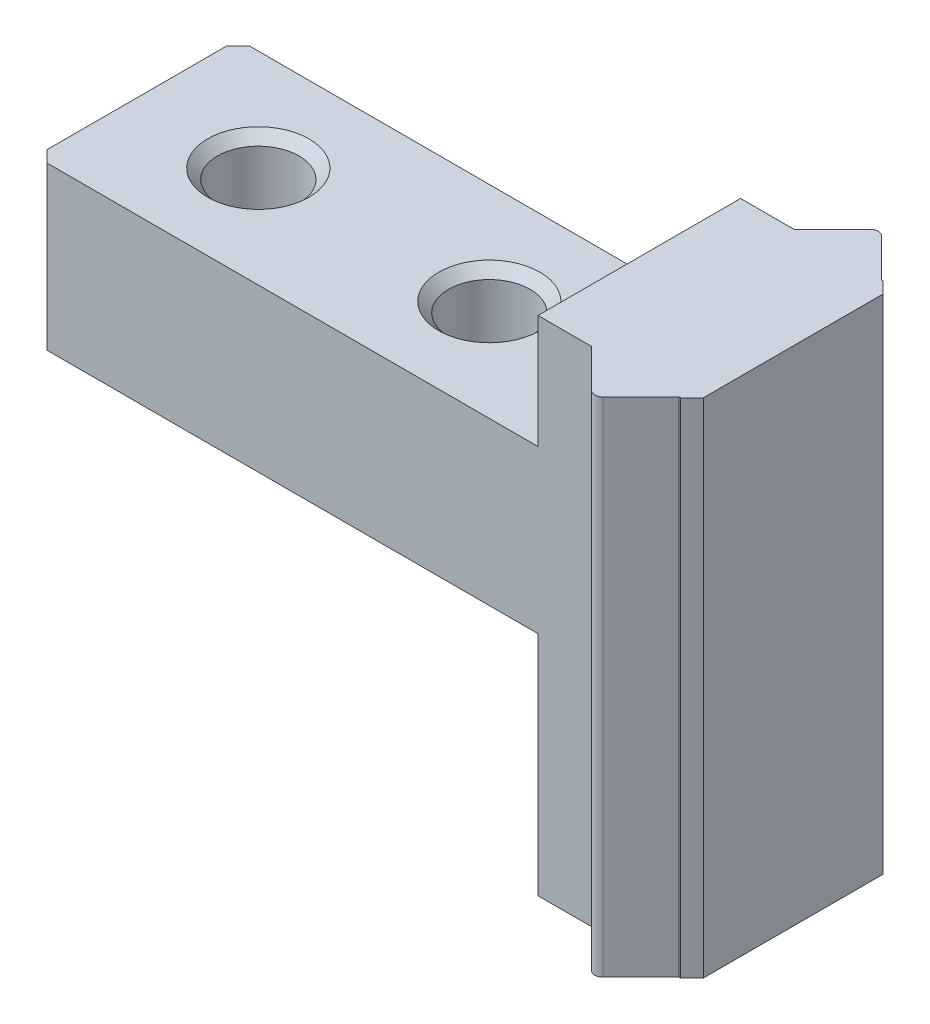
ISO-10303-21;
HEADER;
FILE_DESCRIPTION(('STEP AP214'),'2;1');
FILE_NAME('part.step','',(''),(''),'','','');
FILE_SCHEMA(('AUTOMOTIVE_DESIGN { 1 0 10303 214 1 1 1 1 }'));
ENDSEC;
DATA;
#1=APPLICATION_CONTEXT('core data for automotive mechanical design processes');
#2=APPLICATION_PROTOCOL_DEFINITION('international standard','automotive_design',2000,#1);
#3=PRODUCT_CONTEXT('',#1,'mechanical');
#4=PRODUCT('Part','Part','',(#3));
#5=PRODUCT_RELATED_PRODUCT_CATEGORY('part','',(#4));
#6=PRODUCT_DEFINITION_FORMATION('','',#4);
#7=PRODUCT_DEFINITION_CONTEXT('part definition',#1,'design');
#8=PRODUCT_DEFINITION('design','',#6,#7);
#9=PRODUCT_DEFINITION_SHAPE('','',#8);
#10=(LENGTH_UNIT() NAMED_UNIT(*) SI_UNIT(.MILLI.,.METRE.));
#11=(NAMED_UNIT(*) PLANE_ANGLE_UNIT() SI_UNIT($,.RADIAN.));
#12=(NAMED_UNIT(*) SI_UNIT($,.STERADIAN.) SOLID_ANGLE_UNIT());
#13=UNCERTAINTY_MEASURE_WITH_UNIT(LENGTH_MEASURE(1.E-05),#10,'distance_accuracy_value','');
#14=(GEOMETRIC_REPRESENTATION_CONTEXT(3) GLOBAL_UNCERTAINTY_ASSIGNED_CONTEXT((#13)) GLOBAL_UNIT_ASSIGNED_CONTEXT((#10,
#11,#12)) REPRESENTATION_CONTEXT('',''));
#15=CARTESIAN_POINT('',(0.,0.,0.));
#16=DIRECTION('',(0.,0.,1.));
#17=DIRECTION('',(1.,0.,0.));
#18=AXIS2_PLACEMENT_3D('',#15,#16,#17);
#19=CARTESIAN_POINT('',(-44.6,14.4,-2.5));
#20=DIRECTION('',(1.,0.,0.));
#21=DIRECTION('',(0.,0.,-1.));
#22=AXIS2_PLACEMENT_3D('',#19,#20,#21);
#23=PLANE('',#22);
#24=DIRECTION('',(0.,0.,-1.));
#25=VECTOR('',#24,1.);
#26=CARTESIAN_POINT('',(-44.6,11.6,2.5));
#27=LINE('',#26,#25);
#28=CARTESIAN_POINT('',(-44.6,11.6,2.5));
#29=VERTEX_POINT('',#28);
#30=CARTESIAN_POINT('',(-44.6,11.6,-2.5));
#31=VERTEX_POINT('',#30);
#32=EDGE_CURVE('E340',#29,#31,#27,.T.);
#33=ORIENTED_EDGE('',*,*,#32,.F.);
#34=DIRECTION('',(0.,-1.,0.));
#35=VECTOR('',#34,1.);
#36=CARTESIAN_POINT('',(-44.6,14.4,2.5));
#37=LINE('',#36,#35);
#38=CARTESIAN_POINT('',(-44.6,14.4,2.5));
#39=VERTEX_POINT('',#38);
#40=EDGE_CURVE('E11',#39,#29,#37,.T.);
#41=ORIENTED_EDGE('',*,*,#40,.F.);
#42=DIRECTION('',(0.,0.,1.));
#43=VECTOR('',#42,1.);
#44=CARTESIAN_POINT('',(-44.6,14.4,-2.5));
#45=LINE('',#44,#43);
#46=CARTESIAN_POINT('',(-44.6,14.4,-2.5));
#47=VERTEX_POINT('',#46);
#48=EDGE_CURVE('E187',#47,#39,#45,.T.);
#49=ORIENTED_EDGE('',*,*,#48,.F.);
#50=DIRECTION('',(0.,-1.,0.));
#51=VECTOR('',#50,1.);
#52=CARTESIAN_POINT('',(-44.6,14.4,-2.5));
#53=LINE('',#52,#51);
#54=EDGE_CURVE('E251',#47,#31,#53,.T.);
#55=ORIENTED_EDGE('',*,*,#54,.T.);
#56=EDGE_LOOP('',(#33,#41,#49,#55));
#57=FACE_BOUND('',#56,.T.);
#58=ADVANCED_FACE('F16',(#57),#23,.F.);
#59=CARTESIAN_POINT('',(-44.6,7.6,2.5));
#60=VERTEX_POINT('',#59);
#61=CARTESIAN_POINT('',(-44.6,2.,2.5));
#62=VERTEX_POINT('',#61);
#63=EDGE_CURVE('E25',#60,#62,#37,.T.);
#64=ORIENTED_EDGE('',*,*,#63,.F.);
#65=DIRECTION('',(0.,0.,-1.));
#66=VECTOR('',#65,1.);
#67=CARTESIAN_POINT('',(-44.6,7.6,2.5));
#68=LINE('',#67,#66);
#69=CARTESIAN_POINT('',(-44.6,7.6,-2.5));
#70=VERTEX_POINT('',#69);
#71=EDGE_CURVE('E33',#60,#70,#68,.T.);
#72=ORIENTED_EDGE('',*,*,#71,.T.);
#73=CARTESIAN_POINT('',(-44.6,2.,-2.5));
#74=VERTEX_POINT('',#73);
#75=EDGE_CURVE('E216',#70,#74,#53,.T.);
#76=ORIENTED_EDGE('',*,*,#75,.T.);
#77=DIRECTION('',(0.,0.,1.));
#78=VECTOR('',#77,1.);
#79=CARTESIAN_POINT('',(-44.6,2.,-2.5));
#80=LINE('',#79,#78);
#81=EDGE_CURVE('E179',#74,#62,#80,.T.);
#82=ORIENTED_EDGE('',*,*,#81,.T.);
#83=EDGE_LOOP('',(#64,#72,#76,#82));
#84=FACE_BOUND('',#83,.T.);
#85=ADVANCED_FACE('F18',(#84),#23,.F.);
#86=CARTESIAN_POINT('',(-44.6,14.4,2.5));
#87=DIRECTION('',(0.,0.,-1.));
#88=DIRECTION('',(-1.,0.,0.));
#89=AXIS2_PLACEMENT_3D('',#86,#87,#88);
#90=PLANE('',#89);
#91=DIRECTION('',(1.,0.,0.));
#92=VECTOR('',#91,1.);
#93=CARTESIAN_POINT('',(-44.6,2.,2.5));
#94=LINE('',#93,#92);
#95=CARTESIAN_POINT('',(-43.28,2.,2.5));
#96=VERTEX_POINT('',#95);
#97=EDGE_CURVE('E181',#62,#96,#94,.T.);
#98=ORIENTED_EDGE('',*,*,#97,.T.);
#99=DIRECTION('',(0.,-1.,0.));
#100=VECTOR('',#99,1.);
#101=CARTESIAN_POINT('',(-43.28,14.4,2.5));
#102=LINE('',#101,#100);
#103=CARTESIAN_POINT('',(-43.28,14.4,2.5));
#104=VERTEX_POINT('',#103);
#105=EDGE_CURVE('E254',#104,#96,#102,.T.);
#106=ORIENTED_EDGE('',*,*,#105,.F.);
#107=DIRECTION('',(1.,0.,0.));
#108=VECTOR('',#107,1.);
#109=CARTESIAN_POINT('',(-44.6,14.4,2.5));
#110=LINE('',#109,#108);
#111=EDGE_CURVE('E190',#39,#104,#110,.T.);
#112=ORIENTED_EDGE('',*,*,#111,.F.);
#113=ORIENTED_EDGE('',*,*,#40,.T.);
#114=DIRECTION('',(1.,0.,0.));
#115=VECTOR('',#114,1.);
#116=CARTESIAN_POINT('',(-56.7171572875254,11.6,2.5));
#117=LINE('',#116,#115);
#118=CARTESIAN_POINT('',(-56.7171572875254,11.6,2.5));
#119=VERTEX_POINT('',#118);
#120=EDGE_CURVE('E164',#119,#29,#117,.T.);
#121=ORIENTED_EDGE('',*,*,#120,.F.);
#122=DIRECTION('',(0.,-1.,0.));
#123=VECTOR('',#122,1.);
#124=CARTESIAN_POINT('',(-56.7171572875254,11.6,2.5));
#125=LINE('',#124,#123);
#126=CARTESIAN_POINT('',(-56.7171572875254,7.6,2.5));
#127=VERTEX_POINT('',#126);
#128=EDGE_CURVE('E160',#119,#127,#125,.T.);
#129=ORIENTED_EDGE('',*,*,#128,.T.);
#130=DIRECTION('',(1.,0.,0.));
#131=VECTOR('',#130,1.);
#132=CARTESIAN_POINT('',(-56.7171572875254,7.6,2.5));
#133=LINE('',#132,#131);
#134=EDGE_CURVE('E315',#127,#60,#133,.T.);
#135=ORIENTED_EDGE('',*,*,#134,.T.);
#136=ORIENTED_EDGE('',*,*,#63,.T.);
#137=EDGE_LOOP('',(#98,#106,#112,#113,#121,#129,#135,#136));
#138=FACE_BOUND('',#137,.T.);
#139=ADVANCED_FACE('F362',(#138),#90,.F.);
#140=CARTESIAN_POINT('',(-43.28,14.4,2.5));
#141=DIRECTION('',(0.707106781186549,0.,-0.707106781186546));
#142=DIRECTION('',(-0.707106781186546,0.,-0.707106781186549));
#143=AXIS2_PLACEMENT_3D('',#140,#141,#142);
#144=PLANE('',#143);
#145=DIRECTION('',(0.707106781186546,0.,0.707106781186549));
#146=VECTOR('',#145,1.);
#147=CARTESIAN_POINT('',(-43.28,2.,2.5));
#148=LINE('',#147,#146);
#149=CARTESIAN_POINT('',(-42.3414213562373,2.,3.43857864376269));
#150=VERTEX_POINT('',#149);
#151=EDGE_CURVE('E219',#96,#150,#148,.T.);
#152=ORIENTED_EDGE('',*,*,#151,.T.);
#153=DIRECTION('',(0.,-1.,0.));
#154=VECTOR('',#153,1.);
#155=CARTESIAN_POINT('',(-42.3414213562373,14.4,3.43857864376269));
#156=LINE('',#155,#154);
#157=CARTESIAN_POINT('',(-42.3414213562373,14.4,3.43857864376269));
#158=VERTEX_POINT('',#157);
#159=EDGE_CURVE('E260',#158,#150,#156,.T.);
#160=ORIENTED_EDGE('',*,*,#159,.F.);
#161=DIRECTION('',(0.707106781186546,0.,0.707106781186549));
#162=VECTOR('',#161,1.);
#163=CARTESIAN_POINT('',(-43.28,14.4,2.5));
#164=LINE('',#163,#162);
#165=EDGE_CURVE('E193',#104,#158,#164,.T.);
#166=ORIENTED_EDGE('',*,*,#165,.F.);
#167=ORIENTED_EDGE('',*,*,#105,.T.);
#168=EDGE_LOOP('',(#152,#160,#166,#167));
#169=FACE_BOUND('',#168,.T.);
#170=ADVANCED_FACE('F391',(#169),#144,.F.);
#171=CARTESIAN_POINT('',(-42.2,14.4,3.29715728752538));
#172=DIRECTION('',(0.,-1.,0.));
#173=DIRECTION('',(0.,0.,-1.));
#174=AXIS2_PLACEMENT_3D('',#171,#172,#173);
#175=CYLINDRICAL_SURFACE('',#174,0.199999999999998);
#176=CARTESIAN_POINT('',(-42.2,2.,3.29715728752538));
#177=DIRECTION('',(0.,1.,0.));
#178=DIRECTION('',(0.,0.,1.));
#179=AXIS2_PLACEMENT_3D('',#176,#177,#178);
#180=CIRCLE('',#179,0.199999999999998);
#181=CARTESIAN_POINT('',(-42.0585786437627,2.,3.43857864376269));
#182=VERTEX_POINT('',#181);
#183=EDGE_CURVE('E221',#150,#182,#180,.T.);
#184=ORIENTED_EDGE('',*,*,#183,.T.);
#185=DIRECTION('',(0.,-1.,0.));
#186=VECTOR('',#185,1.);
#187=CARTESIAN_POINT('',(-42.0585786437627,14.4,3.43857864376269));
#188=LINE('',#187,#186);
#189=CARTESIAN_POINT('',(-42.0585786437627,14.4,3.43857864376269));
#190=VERTEX_POINT('',#189);
#191=EDGE_CURVE('E263',#190,#182,#188,.T.);
#192=ORIENTED_EDGE('',*,*,#191,.F.);
#193=CARTESIAN_POINT('',(-42.2,14.4,3.29715728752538));
#194=DIRECTION('',(0.,1.,0.));
#195=DIRECTION('',(0.,0.,1.));
#196=AXIS2_PLACEMENT_3D('',#193,#194,#195);
#197=CIRCLE('',#196,0.199999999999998);
#198=EDGE_CURVE('E195',#158,#190,#197,.T.);
#199=ORIENTED_EDGE('',*,*,#198,.F.);
#200=ORIENTED_EDGE('',*,*,#159,.T.);
#201=EDGE_LOOP('',(#184,#192,#199,#200));
#202=FACE_BOUND('',#201,.T.);
#203=ADVANCED_FACE('F396',(#202),#175,.T.);
#204=CARTESIAN_POINT('',(-42.0585786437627,14.4,3.43857864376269));
#205=DIRECTION('',(-0.707106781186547,0.,-0.707106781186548));
#206=DIRECTION('',(-0.707106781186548,0.,0.707106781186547));
#207=AXIS2_PLACEMENT_3D('',#204,#205,#206);
#208=PLANE('',#207);
#209=DIRECTION('',(0.707106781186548,0.,-0.707106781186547));
#210=VECTOR('',#209,1.);
#211=CARTESIAN_POINT('',(-42.0585786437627,2.,3.43857864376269));
#212=LINE('',#211,#210);
#213=CARTESIAN_POINT('',(-41.12,2.,2.5));
#214=VERTEX_POINT('',#213);
#215=EDGE_CURVE('E223',#182,#214,#212,.T.);
#216=ORIENTED_EDGE('',*,*,#215,.T.);
#217=DIRECTION('',(0.,-1.,0.));
#218=VECTOR('',#217,1.);
#219=CARTESIAN_POINT('',(-41.12,14.4,2.5));
#220=LINE('',#219,#218);
#221=CARTESIAN_POINT('',(-41.12,14.4,2.5));
#222=VERTEX_POINT('',#221);
#223=EDGE_CURVE('E266',#222,#214,#220,.T.);
#224=ORIENTED_EDGE('',*,*,#223,.F.);
#225=DIRECTION('',(0.707106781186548,0.,-0.707106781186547));
#226=VECTOR('',#225,1.);
#227=CARTESIAN_POINT('',(-42.0585786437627,14.4,3.43857864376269));
#228=LINE('',#227,#226);
#229=EDGE_CURVE('E197',#190,#222,#228,.T.);
#230=ORIENTED_EDGE('',*,*,#229,.F.);
#231=ORIENTED_EDGE('',*,*,#191,.T.);
#232=EDGE_LOOP('',(#216,#224,#230,#231));
#233=FACE_BOUND('',#232,.T.);
#234=ADVANCED_FACE('F402',(#233),#208,.F.);
#235=CARTESIAN_POINT('',(-41.12,14.4,2.5));
#236=DIRECTION('',(0.,0.,-1.));
#237=DIRECTION('',(-1.,0.,0.));
#238=AXIS2_PLACEMENT_3D('',#235,#236,#237);
#239=PLANE('',#238);
#240=DIRECTION('',(1.,0.,0.));
#241=VECTOR('',#240,1.);
#242=CARTESIAN_POINT('',(-41.12,2.,2.5));
#243=LINE('',#242,#241);
#244=CARTESIAN_POINT('',(-41.0828427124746,2.,2.5));
#245=VERTEX_POINT('',#244);
#246=EDGE_CURVE('E225',#214,#245,#243,.T.);
#247=ORIENTED_EDGE('',*,*,#246,.T.);
#248=DIRECTION('',(0.,-1.,0.));
#249=VECTOR('',#248,1.);
#250=CARTESIAN_POINT('',(-41.0828427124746,14.4,2.5));
#251=LINE('',#250,#249);
#252=CARTESIAN_POINT('',(-41.0828427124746,14.4,2.5));
#253=VERTEX_POINT('',#252);
#254=EDGE_CURVE('E269',#253,#245,#251,.T.);
#255=ORIENTED_EDGE('',*,*,#254,.F.);
#256=DIRECTION('',(1.,0.,0.));
#257=VECTOR('',#256,1.);
#258=CARTESIAN_POINT('',(-41.12,14.4,2.5));
#259=LINE('',#258,#257);
#260=EDGE_CURVE('E199',#222,#253,#259,.T.);
#261=ORIENTED_EDGE('',*,*,#260,.F.);
#262=ORIENTED_EDGE('',*,*,#223,.T.);
#263=EDGE_LOOP('',(#247,#255,#261,#262));
#264=FACE_BOUND('',#263,.T.);
#265=ADVANCED_FACE('F406',(#264),#239,.F.);
#266=CARTESIAN_POINT('',(-41.0828427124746,14.4,2.5));
#267=DIRECTION('',(-0.707106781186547,0.,-0.707106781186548));
#268=DIRECTION('',(-0.707106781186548,0.,0.707106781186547));
#269=AXIS2_PLACEMENT_3D('',#266,#267,#268);
#270=PLANE('',#269);
#271=DIRECTION('',(0.707106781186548,0.,-0.707106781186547));
#272=VECTOR('',#271,1.);
#273=CARTESIAN_POINT('',(-41.0828427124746,2.,2.5));
#274=LINE('',#273,#272);
#275=CARTESIAN_POINT('',(-40.8,2.,2.21715728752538));
#276=VERTEX_POINT('',#275);
#277=EDGE_CURVE('E227',#245,#276,#274,.T.);
#278=ORIENTED_EDGE('',*,*,#277,.T.);
#279=DIRECTION('',(0.,-1.,0.));
#280=VECTOR('',#279,1.);
#281=CARTESIAN_POINT('',(-40.8,14.4,2.21715728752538));
#282=LINE('',#281,#280);
#283=CARTESIAN_POINT('',(-40.8,14.4,2.21715728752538));
#284=VERTEX_POINT('',#283);
#285=EDGE_CURVE('E272',#284,#276,#282,.T.);
#286=ORIENTED_EDGE('',*,*,#285,.F.);
#287=DIRECTION('',(0.707106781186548,0.,-0.707106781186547));
#288=VECTOR('',#287,1.);
#289=CARTESIAN_POINT('',(-41.0828427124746,14.4,2.5));
#290=LINE('',#289,#288);
#291=EDGE_CURVE('E201',#253,#284,#290,.T.);
#292=ORIENTED_EDGE('',*,*,#291,.F.);
#293=ORIENTED_EDGE('',*,*,#254,.T.);
#294=EDGE_LOOP('',(#278,#286,#292,#293));
#295=FACE_BOUND('',#294,.T.);
#296=ADVANCED_FACE('F410',(#295),#270,.F.);
#297=CARTESIAN_POINT('',(-40.8,14.4,2.21715728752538));
#298=DIRECTION('',(-1.,0.,0.));
#299=DIRECTION('',(0.,0.,1.));
#300=AXIS2_PLACEMENT_3D('',#297,#298,#299);
#301=PLANE('',#300);
#302=DIRECTION('',(0.,0.,-1.));
#303=VECTOR('',#302,1.);
#304=CARTESIAN_POINT('',(-40.8,2.,2.21715728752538));
#305=LINE('',#304,#303);
#306=CARTESIAN_POINT('',(-40.8,2.,-2.21715728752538));
#307=VERTEX_POINT('',#306);
#308=EDGE_CURVE('E229',#276,#307,#305,.T.);
#309=ORIENTED_EDGE('',*,*,#308,.T.);
#310=DIRECTION('',(0.,-1.,0.));
#311=VECTOR('',#310,1.);
#312=CARTESIAN_POINT('',(-40.8,14.4,-2.21715728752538));
#313=LINE('',#312,#311);
#314=CARTESIAN_POINT('',(-40.8,14.4,-2.21715728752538));
#315=VERTEX_POINT('',#314);
#316=EDGE_CURVE('E275',#315,#307,#313,.T.);
#317=ORIENTED_EDGE('',*,*,#316,.F.);
#318=DIRECTION('',(0.,0.,-1.));
#319=VECTOR('',#318,1.);
#320=CARTESIAN_POINT('',(-40.8,14.4,2.21715728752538));
#321=LINE('',#320,#319);
#322=EDGE_CURVE('E203',#284,#315,#321,.T.);
#323=ORIENTED_EDGE('',*,*,#322,.F.);
#324=ORIENTED_EDGE('',*,*,#285,.T.);
#325=EDGE_LOOP('',(#309,#317,#323,#324));
#326=FACE_BOUND('',#325,.T.);
#327=ADVANCED_FACE('F414',(#326),#301,.F.);
#328=CARTESIAN_POINT('',(-40.8,14.4,-2.21715728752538));
#329=DIRECTION('',(-0.707106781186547,0.,0.707106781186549));
#330=DIRECTION('',(0.707106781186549,0.,0.707106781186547));
#331=AXIS2_PLACEMENT_3D('',#328,#329,#330);
#332=PLANE('',#331);
#333=DIRECTION('',(-0.707106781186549,0.,-0.707106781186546));
#334=VECTOR('',#333,1.);
#335=CARTESIAN_POINT('',(-40.8,2.,-2.21715728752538));
#336=LINE('',#335,#334);
#337=CARTESIAN_POINT('',(-41.0828427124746,2.,-2.5));
#338=VERTEX_POINT('',#337);
#339=EDGE_CURVE('E231',#307,#338,#336,.T.);
#340=ORIENTED_EDGE('',*,*,#339,.T.);
#341=DIRECTION('',(0.,-1.,0.));
#342=VECTOR('',#341,1.);
#343=CARTESIAN_POINT('',(-41.0828427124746,14.4,-2.5));
#344=LINE('',#343,#342);
#345=CARTESIAN_POINT('',(-41.0828427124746,14.4,-2.5));
#346=VERTEX_POINT('',#345);
#347=EDGE_CURVE('E278',#346,#338,#344,.T.);
#348=ORIENTED_EDGE('',*,*,#347,.F.);
#349=DIRECTION('',(-0.707106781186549,0.,-0.707106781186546));
#350=VECTOR('',#349,1.);
#351=CARTESIAN_POINT('',(-40.8,14.4,-2.21715728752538));
#352=LINE('',#351,#350);
#353=EDGE_CURVE('E205',#315,#346,#352,.T.);
#354=ORIENTED_EDGE('',*,*,#353,.F.);
#355=ORIENTED_EDGE('',*,*,#316,.T.);
#356=EDGE_LOOP('',(#340,#348,#354,#355));
#357=FACE_BOUND('',#356,.T.);
#358=ADVANCED_FACE('F418',(#357),#332,.F.);
#359=CARTESIAN_POINT('',(-41.0828427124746,14.4,-2.5));
#360=DIRECTION('',(0.,0.,1.));
#361=DIRECTION('',(1.,0.,0.));
#362=AXIS2_PLACEMENT_3D('',#359,#360,#361);
#363=PLANE('',#362);
#364=DIRECTION('',(-1.,0.,0.));
#365=VECTOR('',#364,1.);
#366=CARTESIAN_POINT('',(-41.0828427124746,2.,-2.5));
#367=LINE('',#366,#365);
#368=CARTESIAN_POINT('',(-41.12,2.,-2.5));
#369=VERTEX_POINT('',#368);
#370=EDGE_CURVE('E233',#338,#369,#367,.T.);
#371=ORIENTED_EDGE('',*,*,#370,.T.);
#372=DIRECTION('',(0.,-1.,0.));
#373=VECTOR('',#372,1.);
#374=CARTESIAN_POINT('',(-41.12,14.4,-2.5));
#375=LINE('',#374,#373);
#376=CARTESIAN_POINT('',(-41.12,14.4,-2.5));
#377=VERTEX_POINT('',#376);
#378=EDGE_CURVE('E281',#377,#369,#375,.T.);
#379=ORIENTED_EDGE('',*,*,#378,.F.);
#380=DIRECTION('',(-1.,0.,0.));
#381=VECTOR('',#380,1.);
#382=CARTESIAN_POINT('',(-41.0828427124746,14.4,-2.5));
#383=LINE('',#382,#381);
#384=EDGE_CURVE('E207',#346,#377,#383,.T.);
#385=ORIENTED_EDGE('',*,*,#384,.F.);
#386=ORIENTED_EDGE('',*,*,#347,.T.);
#387=EDGE_LOOP('',(#371,#379,#385,#386));
#388=FACE_BOUND('',#387,.T.);
#389=ADVANCED_FACE('F422',(#388),#363,.F.);
#390=CARTESIAN_POINT('',(-41.12,14.4,-2.5));
#391=DIRECTION('',(-0.707106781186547,0.,0.707106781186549));
#392=DIRECTION('',(0.707106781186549,0.,0.707106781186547));
#393=AXIS2_PLACEMENT_3D('',#390,#391,#392);
#394=PLANE('',#393);
#395=DIRECTION('',(-0.707106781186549,0.,-0.707106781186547));
#396=VECTOR('',#395,1.);
#397=CARTESIAN_POINT('',(-41.12,2.,-2.5));
#398=LINE('',#397,#396);
#399=CARTESIAN_POINT('',(-42.0585786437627,2.,-3.43857864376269));
#400=VERTEX_POINT('',#399);
#401=EDGE_CURVE('E235',#369,#400,#398,.T.);
#402=ORIENTED_EDGE('',*,*,#401,.T.);
#403=DIRECTION('',(0.,-1.,0.));
#404=VECTOR('',#403,1.);
#405=CARTESIAN_POINT('',(-42.0585786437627,14.4,-3.43857864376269));
#406=LINE('',#405,#404);
#407=CARTESIAN_POINT('',(-42.0585786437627,14.4,-3.43857864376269));
#408=VERTEX_POINT('',#407);
#409=EDGE_CURVE('E284',#408,#400,#406,.T.);
#410=ORIENTED_EDGE('',*,*,#409,.F.);
#411=DIRECTION('',(-0.707106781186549,0.,-0.707106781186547));
#412=VECTOR('',#411,1.);
#413=CARTESIAN_POINT('',(-41.12,14.4,-2.5));
#414=LINE('',#413,#412);
#415=EDGE_CURVE('E209',#377,#408,#414,.T.);
#416=ORIENTED_EDGE('',*,*,#415,.F.);
#417=ORIENTED_EDGE('',*,*,#378,.T.);
#418=EDGE_LOOP('',(#402,#410,#416,#417));
#419=FACE_BOUND('',#418,.T.);
#420=ADVANCED_FACE('F379',(#419),#394,.F.);
#421=CARTESIAN_POINT('',(-42.2,14.4,-3.29715728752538));
#422=DIRECTION('',(0.,-1.,0.));
#423=DIRECTION('',(0.,0.,-1.));
#424=AXIS2_PLACEMENT_3D('',#421,#422,#423);
#425=CYLINDRICAL_SURFACE('',#424,0.199999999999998);
#426=CARTESIAN_POINT('',(-42.2,2.,-3.29715728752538));
#427=DIRECTION('',(0.,1.,0.));
#428=DIRECTION('',(0.,0.,1.));
#429=AXIS2_PLACEMENT_3D('',#426,#427,#428);
#430=CIRCLE('',#429,0.199999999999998);
#431=CARTESIAN_POINT('',(-42.3414213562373,2.,-3.43857864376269));
#432=VERTEX_POINT('',#431);
#433=EDGE_CURVE('E237',#400,#432,#430,.T.);
#434=ORIENTED_EDGE('',*,*,#433,.T.);
#435=DIRECTION('',(0.,-1.,0.));
#436=VECTOR('',#435,1.);
#437=CARTESIAN_POINT('',(-42.3414213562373,14.4,-3.43857864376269));
#438=LINE('',#437,#436);
#439=CARTESIAN_POINT('',(-42.3414213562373,14.4,-3.43857864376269));
#440=VERTEX_POINT('',#439);
#441=EDGE_CURVE('E286',#440,#432,#438,.T.);
#442=ORIENTED_EDGE('',*,*,#441,.F.);
#443=CARTESIAN_POINT('',(-42.2,14.4,-3.29715728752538));
#444=DIRECTION('',(0.,1.,0.));
#445=DIRECTION('',(0.,0.,1.));
#446=AXIS2_PLACEMENT_3D('',#443,#444,#445);
#447=CIRCLE('',#446,0.199999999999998);
#448=EDGE_CURVE('E211',#408,#440,#447,.T.);
#449=ORIENTED_EDGE('',*,*,#448,.F.);
#450=ORIENTED_EDGE('',*,*,#409,.T.);
#451=EDGE_LOOP('',(#434,#442,#449,#450));
#452=FACE_BOUND('',#451,.T.);
#453=ADVANCED_FACE('F370',(#452),#425,.T.);
#454=CARTESIAN_POINT('',(-42.3414213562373,14.4,-3.43857864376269));
#455=DIRECTION('',(0.707106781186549,0.,0.707106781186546));
#456=DIRECTION('',(0.707106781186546,0.,-0.707106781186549));
#457=AXIS2_PLACEMENT_3D('',#454,#455,#456);
#458=PLANE('',#457);
#459=DIRECTION('',(-0.707106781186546,0.,0.707106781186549));
#460=VECTOR('',#459,1.);
#461=CARTESIAN_POINT('',(-42.3414213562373,2.,-3.43857864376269));
#462=LINE('',#461,#460);
#463=CARTESIAN_POINT('',(-43.28,2.,-2.5));
#464=VERTEX_POINT('',#463);
#465=EDGE_CURVE('E239',#432,#464,#462,.T.);
#466=ORIENTED_EDGE('',*,*,#465,.T.);
#467=DIRECTION('',(0.,-1.,0.));
#468=VECTOR('',#467,1.);
#469=CARTESIAN_POINT('',(-43.28,14.4,-2.5));
#470=LINE('',#469,#468);
#471=CARTESIAN_POINT('',(-43.28,14.4,-2.5));
#472=VERTEX_POINT('',#471);
#473=EDGE_CURVE('E245',#472,#464,#470,.T.);
#474=ORIENTED_EDGE('',*,*,#473,.F.);
#475=DIRECTION('',(-0.707106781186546,0.,0.707106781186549));
#476=VECTOR('',#475,1.);
#477=CARTESIAN_POINT('',(-42.3414213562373,14.4,-3.43857864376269));
#478=LINE('',#477,#476);
#479=EDGE_CURVE('E213',#440,#472,#478,.T.);
#480=ORIENTED_EDGE('',*,*,#479,.F.);
#481=ORIENTED_EDGE('',*,*,#441,.T.);
#482=EDGE_LOOP('',(#466,#474,#480,#481));
#483=FACE_BOUND('',#482,.T.);
#484=ADVANCED_FACE('F368',(#483),#458,.F.);
#485=CARTESIAN_POINT('',(-43.28,14.4,-2.5));
#486=DIRECTION('',(0.,0.,1.));
#487=DIRECTION('',(1.,0.,0.));
#488=AXIS2_PLACEMENT_3D('',#485,#486,#487);
#489=PLANE('',#488);
#490=DIRECTION('',(-1.,0.,0.));
#491=VECTOR('',#490,1.);
#492=CARTESIAN_POINT('',(-43.28,2.,-2.5));
#493=LINE('',#492,#491);
#494=EDGE_CURVE('E191',#464,#74,#493,.T.);
#495=ORIENTED_EDGE('',*,*,#494,.T.);
#496=ORIENTED_EDGE('',*,*,#75,.F.);
#497=DIRECTION('',(-1.,0.,0.));
#498=VECTOR('',#497,1.);
#499=CARTESIAN_POINT('',(-44.6,7.6,-2.5));
#500=LINE('',#499,#498);
#501=CARTESIAN_POINT('',(-56.7171572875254,7.6,-2.5));
#502=VERTEX_POINT('',#501);
#503=EDGE_CURVE('E307',#70,#502,#500,.T.);
#504=ORIENTED_EDGE('',*,*,#503,.T.);
#505=DIRECTION('',(0.,-1.,0.));
#506=VECTOR('',#505,1.);
#507=CARTESIAN_POINT('',(-56.7171572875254,11.6,-2.5));
#508=LINE('',#507,#506);
#509=CARTESIAN_POINT('',(-56.7171572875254,11.6,-2.5));
#510=VERTEX_POINT('',#509);
#511=EDGE_CURVE('E183',#510,#502,#508,.T.);
#512=ORIENTED_EDGE('',*,*,#511,.F.);
#513=DIRECTION('',(-1.,0.,0.));
#514=VECTOR('',#513,1.);
#515=CARTESIAN_POINT('',(-44.6,11.6,-2.5));
#516=LINE('',#515,#514);
#517=EDGE_CURVE('E343',#31,#510,#516,.T.);
#518=ORIENTED_EDGE('',*,*,#517,.F.);
#519=ORIENTED_EDGE('',*,*,#54,.F.);
#520=DIRECTION('',(-1.,0.,0.));
#521=VECTOR('',#520,1.);
#522=CARTESIAN_POINT('',(-43.28,14.4,-2.5));
#523=LINE('',#522,#521);
#524=EDGE_CURVE('E215',#472,#47,#523,.T.);
#525=ORIENTED_EDGE('',*,*,#524,.F.);
#526=ORIENTED_EDGE('',*,*,#473,.T.);
#527=EDGE_LOOP('',(#495,#496,#504,#512,#518,#519,#525,#526));
#528=FACE_BOUND('',#527,.T.);
#529=ADVANCED_FACE('F297',(#528),#489,.F.);
#530=CARTESIAN_POINT('',(-42.2,14.4,3.29715728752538));
#531=DIRECTION('',(0.,1.,0.));
#532=DIRECTION('',(0.,0.,1.));
#533=AXIS2_PLACEMENT_3D('',#530,#531,#532);
#534=PLANE('',#533);
#535=ORIENTED_EDGE('',*,*,#48,.T.);
#536=ORIENTED_EDGE('',*,*,#111,.T.);
#537=ORIENTED_EDGE('',*,*,#165,.T.);
#538=ORIENTED_EDGE('',*,*,#198,.T.);
#539=ORIENTED_EDGE('',*,*,#229,.T.);
#540=ORIENTED_EDGE('',*,*,#260,.T.);
#541=ORIENTED_EDGE('',*,*,#291,.T.);
#542=ORIENTED_EDGE('',*,*,#322,.T.);
#543=ORIENTED_EDGE('',*,*,#353,.T.);
#544=ORIENTED_EDGE('',*,*,#384,.T.);
#545=ORIENTED_EDGE('',*,*,#415,.T.);
#546=ORIENTED_EDGE('',*,*,#448,.T.);
#547=ORIENTED_EDGE('',*,*,#479,.T.);
#548=ORIENTED_EDGE('',*,*,#524,.T.);
#549=EDGE_LOOP('',(#535,#536,#537,#538,#539,#540,#541,#542,#543,#544,#545,#546,#547,#548));
#550=FACE_BOUND('',#549,.T.);
#551=ADVANCED_FACE('F366',(#550),#534,.T.);
#552=CARTESIAN_POINT('',(-42.2,2.,3.29715728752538));
#553=DIRECTION('',(0.,1.,0.));
#554=DIRECTION('',(0.,0.,1.));
#555=AXIS2_PLACEMENT_3D('',#552,#553,#554);
#556=PLANE('',#555);
#557=ORIENTED_EDGE('',*,*,#81,.F.);
#558=ORIENTED_EDGE('',*,*,#494,.F.);
#559=ORIENTED_EDGE('',*,*,#465,.F.);
#560=ORIENTED_EDGE('',*,*,#433,.F.);
#561=ORIENTED_EDGE('',*,*,#401,.F.);
#562=ORIENTED_EDGE('',*,*,#370,.F.);
#563=ORIENTED_EDGE('',*,*,#339,.F.);
#564=ORIENTED_EDGE('',*,*,#308,.F.);
#565=ORIENTED_EDGE('',*,*,#277,.F.);
#566=ORIENTED_EDGE('',*,*,#246,.F.);
#567=ORIENTED_EDGE('',*,*,#215,.F.);
#568=ORIENTED_EDGE('',*,*,#183,.F.);
#569=ORIENTED_EDGE('',*,*,#151,.F.);
#570=ORIENTED_EDGE('',*,*,#97,.F.);
#571=EDGE_LOOP('',(#557,#558,#559,#560,#561,#562,#563,#564,#565,#566,#567,#568,#569,#570));
#572=FACE_BOUND('',#571,.T.);
#573=ADVANCED_FACE('F301',(#572),#556,.F.);
#574=CARTESIAN_POINT('',(-57.,11.6,-2.21715728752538));
#575=DIRECTION('',(1.,0.,0.));
#576=DIRECTION('',(0.,0.,-1.));
#577=AXIS2_PLACEMENT_3D('',#574,#575,#576);
#578=PLANE('',#577);
#579=DIRECTION('',(0.,0.,1.));
#580=VECTOR('',#579,1.);
#581=CARTESIAN_POINT('',(-57.,7.6,-2.21715728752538));
#582=LINE('',#581,#580);
#583=CARTESIAN_POINT('',(-57.,7.6,-2.21715728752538));
#584=VERTEX_POINT('',#583);
#585=CARTESIAN_POINT('',(-57.,7.6,2.21715728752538));
#586=VERTEX_POINT('',#585);
#587=EDGE_CURVE('E178',#584,#586,#582,.T.);
#588=ORIENTED_EDGE('',*,*,#587,.T.);
#589=DIRECTION('',(0.,-1.,0.));
#590=VECTOR('',#589,1.);
#591=CARTESIAN_POINT('',(-57.,11.6,2.21715728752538));
#592=LINE('',#591,#590);
#593=CARTESIAN_POINT('',(-57.,11.6,2.21715728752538));
#594=VERTEX_POINT('',#593);
#595=EDGE_CURVE('E157',#594,#586,#592,.T.);
#596=ORIENTED_EDGE('',*,*,#595,.F.);
#597=DIRECTION('',(0.,0.,1.));
#598=VECTOR('',#597,1.);
#599=CARTESIAN_POINT('',(-57.,11.6,-2.21715728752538));
#600=LINE('',#599,#598);
#601=CARTESIAN_POINT('',(-57.,11.6,-2.21715728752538));
#602=VERTEX_POINT('',#601);
#603=EDGE_CURVE('E165',#602,#594,#600,.T.);
#604=ORIENTED_EDGE('',*,*,#603,.F.);
#605=DIRECTION('',(0.,-1.,0.));
#606=VECTOR('',#605,1.);
#607=CARTESIAN_POINT('',(-57.,11.6,-2.21715728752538));
#608=LINE('',#607,#606);
#609=EDGE_CURVE('E355',#602,#584,#608,.T.);
#610=ORIENTED_EDGE('',*,*,#609,.T.);
#611=EDGE_LOOP('',(#588,#596,#604,#610));
#612=FACE_BOUND('',#611,.T.);
#613=ADVANCED_FACE('F176',(#612),#578,.F.);
#614=CARTESIAN_POINT('',(-57.,11.6,2.21715728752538));
#615=DIRECTION('',(0.707106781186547,0.,-0.707106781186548));
#616=DIRECTION('',(-0.707106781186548,0.,-0.707106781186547));
#617=AXIS2_PLACEMENT_3D('',#614,#615,#616);
#618=PLANE('',#617);
#619=DIRECTION('',(0.707106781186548,0.,0.707106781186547));
#620=VECTOR('',#619,1.);
#621=CARTESIAN_POINT('',(-57.,7.6,2.21715728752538));
#622=LINE('',#621,#620);
#623=EDGE_CURVE('E326',#586,#127,#622,.T.);
#624=ORIENTED_EDGE('',*,*,#623,.T.);
#625=ORIENTED_EDGE('',*,*,#128,.F.);
#626=DIRECTION('',(0.707106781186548,0.,0.707106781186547));
#627=VECTOR('',#626,1.);
#628=CARTESIAN_POINT('',(-57.,11.6,2.21715728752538));
#629=LINE('',#628,#627);
#630=EDGE_CURVE('E153',#594,#119,#629,.T.);
#631=ORIENTED_EDGE('',*,*,#630,.F.);
#632=ORIENTED_EDGE('',*,*,#595,.T.);
#633=EDGE_LOOP('',(#624,#625,#631,#632));
#634=FACE_BOUND('',#633,.T.);
#635=ADVANCED_FACE('F155',(#634),#618,.F.);
#636=CARTESIAN_POINT('',(-56.7171572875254,11.6,-2.5));
#637=DIRECTION('',(0.707106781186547,0.,0.707106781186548));
#638=DIRECTION('',(0.707106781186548,0.,-0.707106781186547));
#639=AXIS2_PLACEMENT_3D('',#636,#637,#638);
#640=PLANE('',#639);
#641=DIRECTION('',(-0.707106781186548,0.,0.707106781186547));
#642=VECTOR('',#641,1.);
#643=CARTESIAN_POINT('',(-56.7171572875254,7.6,-2.5));
#644=LINE('',#643,#642);
#645=EDGE_CURVE('E174',#502,#584,#644,.T.);
#646=ORIENTED_EDGE('',*,*,#645,.T.);
#647=ORIENTED_EDGE('',*,*,#609,.F.);
#648=DIRECTION('',(-0.707106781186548,0.,0.707106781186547));
#649=VECTOR('',#648,1.);
#650=CARTESIAN_POINT('',(-56.7171572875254,11.6,-2.5));
#651=LINE('',#650,#649);
#652=EDGE_CURVE('E170',#510,#602,#651,.T.);
#653=ORIENTED_EDGE('',*,*,#652,.F.);
#654=ORIENTED_EDGE('',*,*,#511,.T.);
#655=EDGE_LOOP('',(#646,#647,#653,#654));
#656=FACE_BOUND('',#655,.T.);
#657=ADVANCED_FACE('F357',(#656),#640,.F.);
#658=CARTESIAN_POINT('',(0.,11.6,0.));
#659=DIRECTION('',(0.,1.,0.));
#660=DIRECTION('',(0.,0.,1.));
#661=AXIS2_PLACEMENT_3D('',#658,#659,#660);
#662=PLANE('',#661);
#663=CARTESIAN_POINT('',(-48.3,11.6,0.));
#664=DIRECTION('',(0.,-1.,0.));
#665=DIRECTION('',(0.,0.,-1.));
#666=AXIS2_PLACEMENT_3D('',#663,#664,#665);
#667=CIRCLE('',#666,1.25);
#668=CARTESIAN_POINT('',(-48.3,11.6,-1.25));
#669=VERTEX_POINT('',#668);
#670=EDGE_CURVE('E755',#669,#669,#667,.T.);
#671=ORIENTED_EDGE('',*,*,#670,.T.);
#672=EDGE_LOOP('',(#671));
#673=FACE_BOUND('',#672,.T.);
#674=CARTESIAN_POINT('',(-54.,11.6,0.));
#675=DIRECTION('',(0.,-1.,0.));
#676=DIRECTION('',(0.,0.,-1.));
#677=AXIS2_PLACEMENT_3D('',#674,#675,#676);
#678=CIRCLE('',#677,1.25);
#679=CARTESIAN_POINT('',(-54.,11.6,-1.25));
#680=VERTEX_POINT('',#679);
#681=EDGE_CURVE('E334',#680,#680,#678,.T.);
#682=ORIENTED_EDGE('',*,*,#681,.T.);
#683=EDGE_LOOP('',(#682));
#684=FACE_BOUND('',#683,.T.);
#685=ORIENTED_EDGE('',*,*,#603,.T.);
#686=ORIENTED_EDGE('',*,*,#630,.T.);
#687=ORIENTED_EDGE('',*,*,#120,.T.);
#688=ORIENTED_EDGE('',*,*,#32,.T.);
#689=ORIENTED_EDGE('',*,*,#517,.T.);
#690=ORIENTED_EDGE('',*,*,#652,.T.);
#691=EDGE_LOOP('',(#685,#686,#687,#688,#689,#690));
#692=FACE_BOUND('',#691,.T.);
#693=ADVANCED_FACE('F168',(#673,#684,#692),#662,.T.);
#694=CARTESIAN_POINT('',(0.,7.6,0.));
#695=DIRECTION('',(0.,1.,0.));
#696=DIRECTION('',(0.,0.,1.));
#697=AXIS2_PLACEMENT_3D('',#694,#695,#696);
#698=PLANE('',#697);
#699=CARTESIAN_POINT('',(-48.3,7.6,0.));
#700=DIRECTION('',(0.,1.,0.));
#701=DIRECTION('',(0.,0.,1.));
#702=AXIS2_PLACEMENT_3D('',#699,#700,#701);
#703=CIRCLE('',#702,1.24);
#704=CARTESIAN_POINT('',(-48.3,7.6,1.24));
#705=VERTEX_POINT('',#704);
#706=EDGE_CURVE('E20',#705,#705,#703,.F.);
#707=ORIENTED_EDGE('',*,*,#706,.F.);
#708=EDGE_LOOP('',(#707));
#709=FACE_BOUND('',#708,.T.);
#710=CARTESIAN_POINT('',(-54.,7.6,0.));
#711=DIRECTION('',(0.,1.,0.));
#712=DIRECTION('',(0.,0.,1.));
#713=AXIS2_PLACEMENT_3D('',#710,#711,#712);
#714=CIRCLE('',#713,1.24);
#715=CARTESIAN_POINT('',(-54.,7.6,1.24));
#716=VERTEX_POINT('',#715);
#717=EDGE_CURVE('E321',#716,#716,#714,.F.);
#718=ORIENTED_EDGE('',*,*,#717,.F.);
#719=EDGE_LOOP('',(#718));
#720=FACE_BOUND('',#719,.T.);
#721=ORIENTED_EDGE('',*,*,#587,.F.);
#722=ORIENTED_EDGE('',*,*,#645,.F.);
#723=ORIENTED_EDGE('',*,*,#503,.F.);
#724=ORIENTED_EDGE('',*,*,#71,.F.);
#725=ORIENTED_EDGE('',*,*,#134,.F.);
#726=ORIENTED_EDGE('',*,*,#623,.F.);
#727=EDGE_LOOP('',(#721,#722,#723,#724,#725,#726));
#728=FACE_BOUND('',#727,.T.);
#729=ADVANCED_FACE('F311',(#709,#720,#728),#698,.F.);
#730=CARTESIAN_POINT('',(-54.,7.8335,0.));
#731=DIRECTION('',(0.,-1.,0.));
#732=DIRECTION('',(0.,0.,-1.));
#733=AXIS2_PLACEMENT_3D('',#730,#731,#732);
#734=CONICAL_SURFACE('',#733,1.0065,0.785398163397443);
#735=CARTESIAN_POINT('',(-54.,7.8335,0.));
#736=DIRECTION('',(0.,-1.,0.));
#737=DIRECTION('',(0.,0.,-1.));
#738=AXIS2_PLACEMENT_3D('',#735,#736,#737);
#739=CIRCLE('',#738,1.0065);
#740=CARTESIAN_POINT('',(-54.,7.8335,-1.0065));
#741=VERTEX_POINT('',#740);
#742=EDGE_CURVE('E323',#741,#741,#739,.T.);
#743=ORIENTED_EDGE('',*,*,#742,.F.);
#744=EDGE_LOOP('',(#743));
#745=FACE_BOUND('',#744,.T.);
#746=ORIENTED_EDGE('',*,*,#717,.T.);
#747=EDGE_LOOP('',(#746));
#748=FACE_BOUND('',#747,.T.);
#749=ADVANCED_FACE('F547',(#745,#748),#734,.F.);
#750=CARTESIAN_POINT('',(-54.,11.6,0.));
#751=DIRECTION('',(0.,-1.,0.));
#752=DIRECTION('',(0.,0.,-1.));
#753=AXIS2_PLACEMENT_3D('',#750,#751,#752);
#754=CYLINDRICAL_SURFACE('',#753,1.0065);
#755=ORIENTED_EDGE('',*,*,#742,.T.);
#756=EDGE_LOOP('',(#755));
#757=FACE_BOUND('',#756,.T.);
#758=CARTESIAN_POINT('',(-54.,11.3565,0.));
#759=DIRECTION('',(0.,-1.,0.));
#760=DIRECTION('',(0.,0.,-1.));
#761=AXIS2_PLACEMENT_3D('',#758,#759,#760);
#762=CIRCLE('',#761,1.0065);
#763=CARTESIAN_POINT('',(-54.,11.3565,-1.0065));
#764=VERTEX_POINT('',#763);
#765=EDGE_CURVE('E329',#764,#764,#762,.T.);
#766=ORIENTED_EDGE('',*,*,#765,.F.);
#767=EDGE_LOOP('',(#766));
#768=FACE_BOUND('',#767,.T.);
#769=ADVANCED_FACE('F557',(#757,#768),#754,.F.);
#770=CARTESIAN_POINT('',(-54.,11.6,0.));
#771=DIRECTION('',(0.,1.,0.));
#772=DIRECTION('',(0.,0.,1.));
#773=AXIS2_PLACEMENT_3D('',#770,#771,#772);
#774=CONICAL_SURFACE('',#773,1.25,0.785398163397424);
#775=ORIENTED_EDGE('',*,*,#765,.T.);
#776=EDGE_LOOP('',(#775));
#777=FACE_BOUND('',#776,.T.);
#778=ORIENTED_EDGE('',*,*,#681,.F.);
#779=EDGE_LOOP('',(#778));
#780=FACE_BOUND('',#779,.T.);
#781=ADVANCED_FACE('F570',(#777,#780),#774,.F.);
#782=CARTESIAN_POINT('',(-48.3,7.8335,0.));
#783=DIRECTION('',(0.,-1.,0.));
#784=DIRECTION('',(0.,0.,-1.));
#785=AXIS2_PLACEMENT_3D('',#782,#783,#784);
#786=CONICAL_SURFACE('',#785,1.0065,0.785398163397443);
#787=CARTESIAN_POINT('',(-48.3,7.8335,0.));
#788=DIRECTION('',(0.,-1.,0.));
#789=DIRECTION('',(0.,0.,-1.));
#790=AXIS2_PLACEMENT_3D('',#787,#788,#789);
#791=CIRCLE('',#790,1.0065);
#792=CARTESIAN_POINT('',(-48.3,7.8335,-1.0065));
#793=VERTEX_POINT('',#792);
#794=EDGE_CURVE('E757',#793,#793,#791,.T.);
#795=ORIENTED_EDGE('',*,*,#794,.F.);
#796=EDGE_LOOP('',(#795));
#797=FACE_BOUND('',#796,.T.);
#798=ORIENTED_EDGE('',*,*,#706,.T.);
#799=EDGE_LOOP('',(#798));
#800=FACE_BOUND('',#799,.T.);
#801=ADVANCED_FACE('F580',(#797,#800),#786,.F.);
#802=CARTESIAN_POINT('',(-48.3,11.6,0.));
#803=DIRECTION('',(0.,-1.,0.));
#804=DIRECTION('',(0.,0.,-1.));
#805=AXIS2_PLACEMENT_3D('',#802,#803,#804);
#806=CYLINDRICAL_SURFACE('',#805,1.0065);
#807=ORIENTED_EDGE('',*,*,#794,.T.);
#808=EDGE_LOOP('',(#807));
#809=FACE_BOUND('',#808,.T.);
#810=CARTESIAN_POINT('',(-48.3,11.3565,0.));
#811=DIRECTION('',(0.,-1.,0.));
#812=DIRECTION('',(0.,0.,-1.));
#813=AXIS2_PLACEMENT_3D('',#810,#811,#812);
#814=CIRCLE('',#813,1.0065);
#815=CARTESIAN_POINT('',(-48.3,11.3565,-1.0065));
#816=VERTEX_POINT('',#815);
#817=EDGE_CURVE('E752',#816,#816,#814,.T.);
#818=ORIENTED_EDGE('',*,*,#817,.F.);
#819=EDGE_LOOP('',(#818));
#820=FACE_BOUND('',#819,.T.);
#821=ADVANCED_FACE('F590',(#809,#820),#806,.F.);
#822=CARTESIAN_POINT('',(-48.3,11.6,0.));
#823=DIRECTION('',(0.,1.,0.));
#824=DIRECTION('',(0.,0.,1.));
#825=AXIS2_PLACEMENT_3D('',#822,#823,#824);
#826=CONICAL_SURFACE('',#825,1.25,0.785398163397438);
#827=ORIENTED_EDGE('',*,*,#817,.T.);
#828=EDGE_LOOP('',(#827));
#829=FACE_BOUND('',#828,.T.);
#830=ORIENTED_EDGE('',*,*,#670,.F.);
#831=EDGE_LOOP('',(#830));
#832=FACE_BOUND('',#831,.T.);
#833=ADVANCED_FACE('F603',(#829,#832),#826,.F.);
#834=CLOSED_SHELL('',(#58,#85,#139,#170,#203,#234,#265,#296,#327,#358,#389,#420,#453,#484,#529,
#551,#573,#613,#635,#657,#693,#729,#749,#769,#781,#801,#821,#833));
#835=MANIFOLD_SOLID_BREP('B1',#834);
#836=ADVANCED_BREP_SHAPE_REPRESENTATION('',(#18,#835),#14);
#837=SHAPE_DEFINITION_REPRESENTATION(#9,#836);
ENDSEC;
END-ISO-10303-21;
